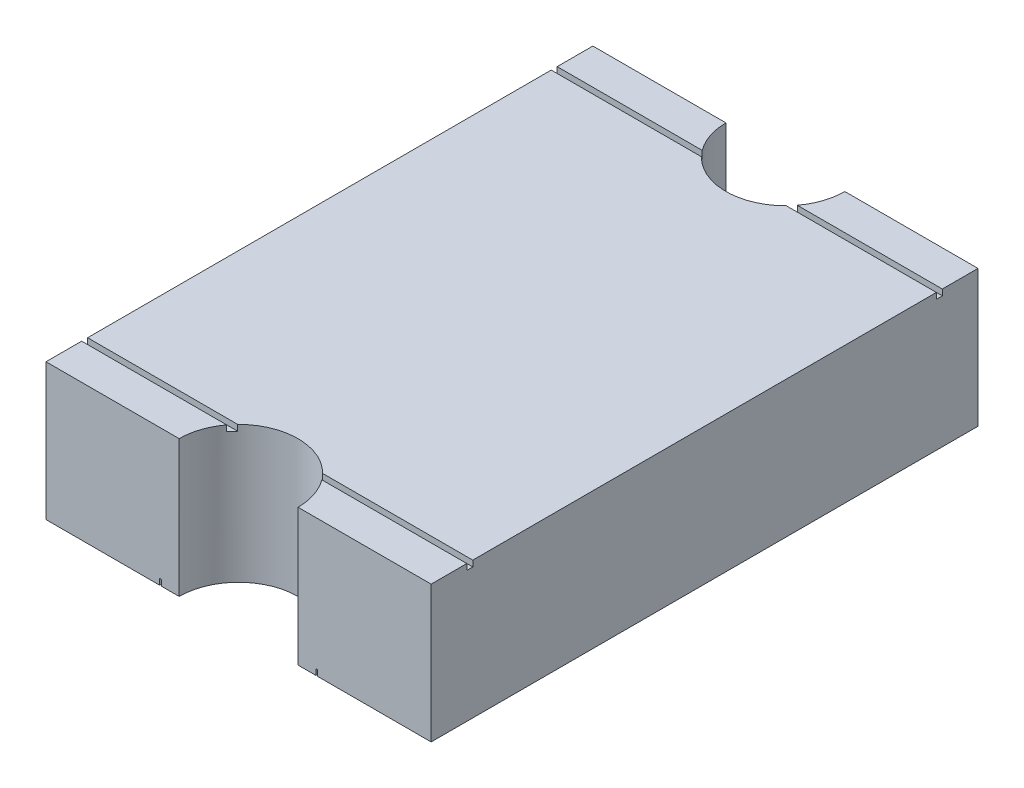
ISO-10303-21;
HEADER;
FILE_DESCRIPTION(('STEP AP214'),'2;1');
FILE_NAME('part.step','',(''),(''),'','','');
FILE_SCHEMA(('AUTOMOTIVE_DESIGN { 1 0 10303 214 1 1 1 1 }'));
ENDSEC;
DATA;
#1=APPLICATION_CONTEXT('core data for automotive mechanical design processes');
#2=APPLICATION_PROTOCOL_DEFINITION('international standard','automotive_design',2000,#1);
#3=PRODUCT_CONTEXT('',#1,'mechanical');
#4=PRODUCT('Part','Part','',(#3));
#5=PRODUCT_RELATED_PRODUCT_CATEGORY('part','',(#4));
#6=PRODUCT_DEFINITION_FORMATION('','',#4);
#7=PRODUCT_DEFINITION_CONTEXT('part definition',#1,'design');
#8=PRODUCT_DEFINITION('design','',#6,#7);
#9=PRODUCT_DEFINITION_SHAPE('','',#8);
#10=(LENGTH_UNIT() NAMED_UNIT(*) SI_UNIT(.MILLI.,.METRE.));
#11=(NAMED_UNIT(*) PLANE_ANGLE_UNIT() SI_UNIT($,.RADIAN.));
#12=(NAMED_UNIT(*) SI_UNIT($,.STERADIAN.) SOLID_ANGLE_UNIT());
#13=UNCERTAINTY_MEASURE_WITH_UNIT(LENGTH_MEASURE(1.E-05),#10,'distance_accuracy_value','');
#14=(GEOMETRIC_REPRESENTATION_CONTEXT(3) GLOBAL_UNCERTAINTY_ASSIGNED_CONTEXT((#13)) GLOBAL_UNIT_ASSIGNED_CONTEXT((#10,
#11,#12)) REPRESENTATION_CONTEXT('',''));
#15=CARTESIAN_POINT('',(0.,0.,0.));
#16=DIRECTION('',(0.,0.,1.));
#17=DIRECTION('',(1.,0.,0.));
#18=AXIS2_PLACEMENT_3D('',#15,#16,#17);
#19=CARTESIAN_POINT('',(0.,0.,2.3));
#20=DIRECTION('',(0.,-1.,0.));
#21=DIRECTION('',(0.,0.,1.));
#22=AXIS2_PLACEMENT_3D('',#19,#20,#21);
#23=CYLINDRICAL_SURFACE('',#22,0.65);
#24=DIRECTION('',(0.,-1.,0.));
#25=VECTOR('',#24,1.);
#26=CARTESIAN_POINT('',(-0.65,0.05,2.3));
#27=LINE('',#26,#25);
#28=CARTESIAN_POINT('',(-0.65,0.05,2.3));
#29=VERTEX_POINT('',#28);
#30=CARTESIAN_POINT('',(-0.65,0.,2.3));
#31=VERTEX_POINT('',#30);
#32=EDGE_CURVE('E382',#29,#31,#27,.T.);
#33=ORIENTED_EDGE('',*,*,#32,.F.);
#34=CARTESIAN_POINT('',(0.,0.05,2.3));
#35=DIRECTION('',(0.,1.,0.));
#36=DIRECTION('',(1.,0.,0.));
#37=AXIS2_PLACEMENT_3D('',#34,#35,#36);
#38=CIRCLE('',#37,0.65);
#39=CARTESIAN_POINT('',(0.65,0.05,2.3));
#40=VERTEX_POINT('',#39);
#41=EDGE_CURVE('E396',#40,#29,#38,.T.);
#42=ORIENTED_EDGE('',*,*,#41,.F.);
#43=DIRECTION('',(0.,-1.,0.));
#44=VECTOR('',#43,1.);
#45=CARTESIAN_POINT('',(0.65,0.05,2.3));
#46=LINE('',#45,#44);
#47=CARTESIAN_POINT('',(0.65,0.,2.3));
#48=VERTEX_POINT('',#47);
#49=EDGE_CURVE('E11',#40,#48,#46,.T.);
#50=ORIENTED_EDGE('',*,*,#49,.T.);
#51=CARTESIAN_POINT('',(0.,0.,2.3));
#52=DIRECTION('',(0.,-1.,0.));
#53=DIRECTION('',(-1.,0.,0.));
#54=AXIS2_PLACEMENT_3D('',#51,#52,#53);
#55=CIRCLE('',#54,0.65);
#56=EDGE_CURVE('E518',#31,#48,#55,.T.);
#57=ORIENTED_EDGE('',*,*,#56,.F.);
#58=EDGE_LOOP('',(#33,#42,#50,#57));
#59=FACE_BOUND('',#58,.T.);
#60=ADVANCED_FACE('F16',(#59),#23,.T.);
#61=CARTESIAN_POINT('',(0.5,0.,2.3));
#62=DIRECTION('',(0.,0.,1.));
#63=DIRECTION('',(1.,0.,0.));
#64=AXIS2_PLACEMENT_3D('',#61,#62,#63);
#65=PLANE('',#64);
#66=DIRECTION('',(0.,-1.,0.));
#67=VECTOR('',#66,1.);
#68=CARTESIAN_POINT('',(0.665,0.05,2.3));
#69=LINE('',#68,#67);
#70=CARTESIAN_POINT('',(0.665,0.05,2.3));
#71=VERTEX_POINT('',#70);
#72=CARTESIAN_POINT('',(0.665,0.,2.3));
#73=VERTEX_POINT('',#72);
#74=EDGE_CURVE('E412',#71,#73,#69,.T.);
#75=ORIENTED_EDGE('',*,*,#74,.T.);
#76=DIRECTION('',(1.,0.,0.));
#77=VECTOR('',#76,1.);
#78=CARTESIAN_POINT('',(0.665,0.,2.3));
#79=LINE('',#78,#77);
#80=CARTESIAN_POINT('',(1.62,0.,2.3));
#81=VERTEX_POINT('',#80);
#82=EDGE_CURVE('E559',#73,#81,#79,.T.);
#83=ORIENTED_EDGE('',*,*,#82,.T.);
#84=DIRECTION('',(0.,1.,0.));
#85=VECTOR('',#84,1.);
#86=CARTESIAN_POINT('',(1.62,0.,2.3));
#87=LINE('',#86,#85);
#88=CARTESIAN_POINT('',(1.62,1.15,2.3));
#89=VERTEX_POINT('',#88);
#90=EDGE_CURVE('E27',#81,#89,#87,.T.);
#91=ORIENTED_EDGE('',*,*,#90,.T.);
#92=DIRECTION('',(1.,0.,0.));
#93=VECTOR('',#92,1.);
#94=CARTESIAN_POINT('',(0.5,1.15,2.3));
#95=LINE('',#94,#93);
#96=CARTESIAN_POINT('',(0.5,1.15,2.3));
#97=VERTEX_POINT('',#96);
#98=EDGE_CURVE('E336',#97,#89,#95,.T.);
#99=ORIENTED_EDGE('',*,*,#98,.F.);
#100=DIRECTION('',(0.,1.,0.));
#101=VECTOR('',#100,1.);
#102=CARTESIAN_POINT('',(0.5,0.,2.3));
#103=LINE('',#102,#101);
#104=CARTESIAN_POINT('',(0.5,0.,2.3));
#105=VERTEX_POINT('',#104);
#106=EDGE_CURVE('E403',#105,#97,#103,.T.);
#107=ORIENTED_EDGE('',*,*,#106,.F.);
#108=DIRECTION('',(1.,0.,0.));
#109=VECTOR('',#108,1.);
#110=CARTESIAN_POINT('',(0.5,0.,2.3));
#111=LINE('',#110,#109);
#112=EDGE_CURVE('E454',#105,#48,#111,.T.);
#113=ORIENTED_EDGE('',*,*,#112,.T.);
#114=ORIENTED_EDGE('',*,*,#49,.F.);
#115=DIRECTION('',(1.,0.,0.));
#116=VECTOR('',#115,1.);
#117=CARTESIAN_POINT('',(0.65,0.05,2.3));
#118=LINE('',#117,#116);
#119=EDGE_CURVE('E373',#40,#71,#118,.T.);
#120=ORIENTED_EDGE('',*,*,#119,.T.);
#121=EDGE_LOOP('',(#75,#83,#91,#99,#107,#113,#114,#120));
#122=FACE_BOUND('',#121,.T.);
#123=ADVANCED_FACE('F745',(#122),#65,.T.);
#124=CARTESIAN_POINT('',(1.62,0.,2.3));
#125=DIRECTION('',(1.,0.,0.));
#126=DIRECTION('',(0.,1.,0.));
#127=AXIS2_PLACEMENT_3D('',#124,#125,#126);
#128=PLANE('',#127);
#129=DIRECTION('',(0.,-1.,0.));
#130=VECTOR('',#129,1.);
#131=CARTESIAN_POINT('',(1.62,1.15,-1.95));
#132=LINE('',#131,#130);
#133=CARTESIAN_POINT('',(1.62,1.15,-1.95));
#134=VERTEX_POINT('',#133);
#135=CARTESIAN_POINT('',(1.62,1.1,-1.95));
#136=VERTEX_POINT('',#135);
#137=EDGE_CURVE('E315',#134,#136,#132,.T.);
#138=ORIENTED_EDGE('',*,*,#137,.F.);
#139=DIRECTION('',(0.,0.,-1.));
#140=VECTOR('',#139,1.);
#141=CARTESIAN_POINT('',(1.62,1.15,1.95));
#142=LINE('',#141,#140);
#143=CARTESIAN_POINT('',(1.62,1.15,1.95));
#144=VERTEX_POINT('',#143);
#145=EDGE_CURVE('E324',#144,#134,#142,.T.);
#146=ORIENTED_EDGE('',*,*,#145,.F.);
#147=DIRECTION('',(0.,-1.,0.));
#148=VECTOR('',#147,1.);
#149=CARTESIAN_POINT('',(1.62,1.15,1.95));
#150=LINE('',#149,#148);
#151=CARTESIAN_POINT('',(1.62,1.1,1.95));
#152=VERTEX_POINT('',#151);
#153=EDGE_CURVE('E404',#144,#152,#150,.T.);
#154=ORIENTED_EDGE('',*,*,#153,.T.);
#155=DIRECTION('',(0.,0.,1.));
#156=VECTOR('',#155,1.);
#157=CARTESIAN_POINT('',(1.62,1.1,1.95));
#158=LINE('',#157,#156);
#159=CARTESIAN_POINT('',(1.62,1.1,2.));
#160=VERTEX_POINT('',#159);
#161=EDGE_CURVE('E465',#152,#160,#158,.T.);
#162=ORIENTED_EDGE('',*,*,#161,.T.);
#163=DIRECTION('',(0.,-1.,0.));
#164=VECTOR('',#163,1.);
#165=CARTESIAN_POINT('',(1.62,1.15,2.));
#166=LINE('',#165,#164);
#167=CARTESIAN_POINT('',(1.62,1.15,2.));
#168=VERTEX_POINT('',#167);
#169=EDGE_CURVE('E201',#168,#160,#166,.T.);
#170=ORIENTED_EDGE('',*,*,#169,.F.);
#171=DIRECTION('',(0.,0.,-1.));
#172=VECTOR('',#171,1.);
#173=CARTESIAN_POINT('',(1.62,1.15,2.3));
#174=LINE('',#173,#172);
#175=EDGE_CURVE('E331',#89,#168,#174,.T.);
#176=ORIENTED_EDGE('',*,*,#175,.F.);
#177=ORIENTED_EDGE('',*,*,#90,.F.);
#178=DIRECTION('',(0.,0.,-1.));
#179=VECTOR('',#178,1.);
#180=CARTESIAN_POINT('',(1.62,0.,2.3));
#181=LINE('',#180,#179);
#182=CARTESIAN_POINT('',(1.62,0.,-2.3));
#183=VERTEX_POINT('',#182);
#184=EDGE_CURVE('E408',#81,#183,#181,.T.);
#185=ORIENTED_EDGE('',*,*,#184,.T.);
#186=DIRECTION('',(0.,1.,0.));
#187=VECTOR('',#186,1.);
#188=CARTESIAN_POINT('',(1.62,0.,-2.3));
#189=LINE('',#188,#187);
#190=CARTESIAN_POINT('',(1.62,1.15,-2.3));
#191=VERTEX_POINT('',#190);
#192=EDGE_CURVE('E431',#183,#191,#189,.T.);
#193=ORIENTED_EDGE('',*,*,#192,.T.);
#194=DIRECTION('',(0.,0.,-1.));
#195=VECTOR('',#194,1.);
#196=CARTESIAN_POINT('',(1.62,1.15,-2.));
#197=LINE('',#196,#195);
#198=CARTESIAN_POINT('',(1.62,1.15,-2.));
#199=VERTEX_POINT('',#198);
#200=EDGE_CURVE('E273',#199,#191,#197,.T.);
#201=ORIENTED_EDGE('',*,*,#200,.F.);
#202=DIRECTION('',(0.,-1.,0.));
#203=VECTOR('',#202,1.);
#204=CARTESIAN_POINT('',(1.62,1.15,-2.));
#205=LINE('',#204,#203);
#206=CARTESIAN_POINT('',(1.62,1.1,-2.));
#207=VERTEX_POINT('',#206);
#208=EDGE_CURVE('E41',#199,#207,#205,.T.);
#209=ORIENTED_EDGE('',*,*,#208,.T.);
#210=DIRECTION('',(0.,0.,1.));
#211=VECTOR('',#210,1.);
#212=CARTESIAN_POINT('',(1.62,1.1,-2.));
#213=LINE('',#212,#211);
#214=EDGE_CURVE('E270',#207,#136,#213,.T.);
#215=ORIENTED_EDGE('',*,*,#214,.T.);
#216=EDGE_LOOP('',(#138,#146,#154,#162,#170,#176,#177,#185,#193,#201,#209,#215));
#217=FACE_BOUND('',#216,.T.);
#218=ADVANCED_FACE('F268',(#217),#128,.T.);
#219=CARTESIAN_POINT('',(1.62,1.15,-2.));
#220=DIRECTION('',(0.,0.,-1.));
#221=DIRECTION('',(0.,-1.,0.));
#222=AXIS2_PLACEMENT_3D('',#219,#220,#221);
#223=PLANE('',#222);
#224=DIRECTION('',(0.,1.,0.));
#225=VECTOR('',#224,1.);
#226=CARTESIAN_POINT('',(0.4,1.1,-2.));
#227=LINE('',#226,#225);
#228=CARTESIAN_POINT('',(0.4,1.1,-2.));
#229=VERTEX_POINT('',#228);
#230=CARTESIAN_POINT('',(0.4,1.15,-2.));
#231=VERTEX_POINT('',#230);
#232=EDGE_CURVE('E282',#229,#231,#227,.T.);
#233=ORIENTED_EDGE('',*,*,#232,.F.);
#234=DIRECTION('',(-1.,0.,0.));
#235=VECTOR('',#234,1.);
#236=CARTESIAN_POINT('',(1.62,1.1,-2.));
#237=LINE('',#236,#235);
#238=EDGE_CURVE('E279',#207,#229,#237,.T.);
#239=ORIENTED_EDGE('',*,*,#238,.F.);
#240=ORIENTED_EDGE('',*,*,#208,.F.);
#241=DIRECTION('',(1.,0.,0.));
#242=VECTOR('',#241,1.);
#243=CARTESIAN_POINT('',(0.4,1.15,-2.));
#244=LINE('',#243,#242);
#245=EDGE_CURVE('E499',#231,#199,#244,.T.);
#246=ORIENTED_EDGE('',*,*,#245,.F.);
#247=EDGE_LOOP('',(#233,#239,#240,#246));
#248=FACE_BOUND('',#247,.T.);
#249=ADVANCED_FACE('F280',(#248),#223,.F.);
#250=CARTESIAN_POINT('',(1.62,1.15,-2.));
#251=DIRECTION('',(0.,0.,-1.));
#252=DIRECTION('',(0.,-1.,0.));
#253=AXIS2_PLACEMENT_3D('',#250,#251,#252);
#254=PLANE('',#253);
#255=DIRECTION('',(0.,-1.,0.));
#256=VECTOR('',#255,1.);
#257=CARTESIAN_POINT('',(-1.62,1.15,-2.));
#258=LINE('',#257,#256);
#259=CARTESIAN_POINT('',(-1.62,1.15,-2.));
#260=VERTEX_POINT('',#259);
#261=CARTESIAN_POINT('',(-1.62,1.1,-2.));
#262=VERTEX_POINT('',#261);
#263=EDGE_CURVE('E275',#260,#262,#258,.T.);
#264=ORIENTED_EDGE('',*,*,#263,.T.);
#265=DIRECTION('',(-1.,0.,0.));
#266=VECTOR('',#265,1.);
#267=CARTESIAN_POINT('',(-0.4,1.1,-2.));
#268=LINE('',#267,#266);
#269=CARTESIAN_POINT('',(-0.4,1.1,-2.));
#270=VERTEX_POINT('',#269);
#271=EDGE_CURVE('E388',#270,#262,#268,.T.);
#272=ORIENTED_EDGE('',*,*,#271,.F.);
#273=DIRECTION('',(0.,1.,0.));
#274=VECTOR('',#273,1.);
#275=CARTESIAN_POINT('',(-0.4,1.1,-2.));
#276=LINE('',#275,#274);
#277=CARTESIAN_POINT('',(-0.4,1.15,-2.));
#278=VERTEX_POINT('',#277);
#279=EDGE_CURVE('E389',#270,#278,#276,.T.);
#280=ORIENTED_EDGE('',*,*,#279,.T.);
#281=DIRECTION('',(1.,0.,0.));
#282=VECTOR('',#281,1.);
#283=CARTESIAN_POINT('',(-1.62,1.15,-2.));
#284=LINE('',#283,#282);
#285=EDGE_CURVE('E493',#260,#278,#284,.T.);
#286=ORIENTED_EDGE('',*,*,#285,.F.);
#287=EDGE_LOOP('',(#264,#272,#280,#286));
#288=FACE_BOUND('',#287,.T.);
#289=ADVANCED_FACE('F842',(#288),#254,.F.);
#290=CARTESIAN_POINT('',(-1.62,0.,-2.3));
#291=DIRECTION('',(-1.,0.,0.));
#292=DIRECTION('',(0.,0.,1.));
#293=AXIS2_PLACEMENT_3D('',#290,#291,#292);
#294=PLANE('',#293);
#295=ORIENTED_EDGE('',*,*,#263,.F.);
#296=DIRECTION('',(0.,0.,1.));
#297=VECTOR('',#296,1.);
#298=CARTESIAN_POINT('',(-1.62,1.15,-2.3));
#299=LINE('',#298,#297);
#300=CARTESIAN_POINT('',(-1.62,1.15,-2.3));
#301=VERTEX_POINT('',#300);
#302=EDGE_CURVE('E339',#301,#260,#299,.T.);
#303=ORIENTED_EDGE('',*,*,#302,.F.);
#304=DIRECTION('',(0.,1.,0.));
#305=VECTOR('',#304,1.);
#306=CARTESIAN_POINT('',(-1.62,0.,-2.3));
#307=LINE('',#306,#305);
#308=CARTESIAN_POINT('',(-1.62,0.,-2.3));
#309=VERTEX_POINT('',#308);
#310=EDGE_CURVE('E367',#309,#301,#307,.T.);
#311=ORIENTED_EDGE('',*,*,#310,.F.);
#312=DIRECTION('',(0.,0.,1.));
#313=VECTOR('',#312,1.);
#314=CARTESIAN_POINT('',(-1.62,0.,-2.3));
#315=LINE('',#314,#313);
#316=CARTESIAN_POINT('',(-1.62,0.,2.3));
#317=VERTEX_POINT('',#316);
#318=EDGE_CURVE('E364',#309,#317,#315,.T.);
#319=ORIENTED_EDGE('',*,*,#318,.T.);
#320=DIRECTION('',(0.,1.,0.));
#321=VECTOR('',#320,1.);
#322=CARTESIAN_POINT('',(-1.62,0.,2.3));
#323=LINE('',#322,#321);
#324=CARTESIAN_POINT('',(-1.62,1.15,2.3));
#325=VERTEX_POINT('',#324);
#326=EDGE_CURVE('E417',#317,#325,#323,.T.);
#327=ORIENTED_EDGE('',*,*,#326,.T.);
#328=DIRECTION('',(0.,0.,1.));
#329=VECTOR('',#328,1.);
#330=CARTESIAN_POINT('',(-1.62,1.15,2.));
#331=LINE('',#330,#329);
#332=CARTESIAN_POINT('',(-1.62,1.15,2.));
#333=VERTEX_POINT('',#332);
#334=EDGE_CURVE('E20',#333,#325,#331,.T.);
#335=ORIENTED_EDGE('',*,*,#334,.F.);
#336=DIRECTION('',(0.,-1.,0.));
#337=VECTOR('',#336,1.);
#338=CARTESIAN_POINT('',(-1.62,1.15,2.));
#339=LINE('',#338,#337);
#340=CARTESIAN_POINT('',(-1.62,1.1,2.));
#341=VERTEX_POINT('',#340);
#342=EDGE_CURVE('E342',#333,#341,#339,.T.);
#343=ORIENTED_EDGE('',*,*,#342,.T.);
#344=DIRECTION('',(0.,0.,1.));
#345=VECTOR('',#344,1.);
#346=CARTESIAN_POINT('',(-1.62,1.1,1.95));
#347=LINE('',#346,#345);
#348=CARTESIAN_POINT('',(-1.62,1.1,1.95));
#349=VERTEX_POINT('',#348);
#350=EDGE_CURVE('E477',#349,#341,#347,.T.);
#351=ORIENTED_EDGE('',*,*,#350,.F.);
#352=DIRECTION('',(0.,-1.,0.));
#353=VECTOR('',#352,1.);
#354=CARTESIAN_POINT('',(-1.62,1.15,1.95));
#355=LINE('',#354,#353);
#356=CARTESIAN_POINT('',(-1.62,1.15,1.95));
#357=VERTEX_POINT('',#356);
#358=EDGE_CURVE('E445',#357,#349,#355,.T.);
#359=ORIENTED_EDGE('',*,*,#358,.F.);
#360=DIRECTION('',(0.,0.,1.));
#361=VECTOR('',#360,1.);
#362=CARTESIAN_POINT('',(-1.62,1.15,-1.95));
#363=LINE('',#362,#361);
#364=CARTESIAN_POINT('',(-1.62,1.15,-1.95));
#365=VERTEX_POINT('',#364);
#366=EDGE_CURVE('E319',#365,#357,#363,.T.);
#367=ORIENTED_EDGE('',*,*,#366,.F.);
#368=DIRECTION('',(0.,-1.,0.));
#369=VECTOR('',#368,1.);
#370=CARTESIAN_POINT('',(-1.62,1.15,-1.95));
#371=LINE('',#370,#369);
#372=CARTESIAN_POINT('',(-1.62,1.1,-1.95));
#373=VERTEX_POINT('',#372);
#374=EDGE_CURVE('E310',#365,#373,#371,.T.);
#375=ORIENTED_EDGE('',*,*,#374,.T.);
#376=DIRECTION('',(0.,0.,1.));
#377=VECTOR('',#376,1.);
#378=CARTESIAN_POINT('',(-1.62,1.1,-2.));
#379=LINE('',#378,#377);
#380=EDGE_CURVE('E356',#262,#373,#379,.T.);
#381=ORIENTED_EDGE('',*,*,#380,.F.);
#382=EDGE_LOOP('',(#295,#303,#311,#319,#327,#335,#343,#351,#359,#367,#375,#381));
#383=FACE_BOUND('',#382,.T.);
#384=ADVANCED_FACE('F837',(#383),#294,.T.);
#385=CARTESIAN_POINT('',(-1.62,1.15,2.));
#386=DIRECTION('',(0.,0.,1.));
#387=DIRECTION('',(1.,0.,0.));
#388=AXIS2_PLACEMENT_3D('',#385,#386,#387);
#389=PLANE('',#388);
#390=ORIENTED_EDGE('',*,*,#169,.T.);
#391=DIRECTION('',(1.,0.,0.));
#392=VECTOR('',#391,1.);
#393=CARTESIAN_POINT('',(0.4,1.1,2.));
#394=LINE('',#393,#392);
#395=CARTESIAN_POINT('',(0.4,1.1,2.));
#396=VERTEX_POINT('',#395);
#397=EDGE_CURVE('E468',#396,#160,#394,.T.);
#398=ORIENTED_EDGE('',*,*,#397,.F.);
#399=DIRECTION('',(0.,1.,0.));
#400=VECTOR('',#399,1.);
#401=CARTESIAN_POINT('',(0.4,1.1,2.));
#402=LINE('',#401,#400);
#403=CARTESIAN_POINT('',(0.4,1.15,2.));
#404=VERTEX_POINT('',#403);
#405=EDGE_CURVE('E213',#396,#404,#402,.T.);
#406=ORIENTED_EDGE('',*,*,#405,.T.);
#407=DIRECTION('',(1.,0.,0.));
#408=VECTOR('',#407,1.);
#409=CARTESIAN_POINT('',(0.4,1.15,2.));
#410=LINE('',#409,#408);
#411=EDGE_CURVE('E335',#404,#168,#410,.T.);
#412=ORIENTED_EDGE('',*,*,#411,.T.);
#413=EDGE_LOOP('',(#390,#398,#406,#412));
#414=FACE_BOUND('',#413,.T.);
#415=ADVANCED_FACE('F841',(#414),#389,.F.);
#416=CARTESIAN_POINT('',(-1.62,1.15,2.));
#417=DIRECTION('',(0.,0.,1.));
#418=DIRECTION('',(1.,0.,0.));
#419=AXIS2_PLACEMENT_3D('',#416,#417,#418);
#420=PLANE('',#419);
#421=DIRECTION('',(0.,1.,0.));
#422=VECTOR('',#421,1.);
#423=CARTESIAN_POINT('',(-0.4,1.1,2.));
#424=LINE('',#423,#422);
#425=CARTESIAN_POINT('',(-0.4,1.1,2.));
#426=VERTEX_POINT('',#425);
#427=CARTESIAN_POINT('',(-0.4,1.15,2.));
#428=VERTEX_POINT('',#427);
#429=EDGE_CURVE('E400',#426,#428,#424,.T.);
#430=ORIENTED_EDGE('',*,*,#429,.F.);
#431=DIRECTION('',(1.,0.,0.));
#432=VECTOR('',#431,1.);
#433=CARTESIAN_POINT('',(-1.62,1.1,2.));
#434=LINE('',#433,#432);
#435=EDGE_CURVE('E287',#341,#426,#434,.T.);
#436=ORIENTED_EDGE('',*,*,#435,.F.);
#437=ORIENTED_EDGE('',*,*,#342,.F.);
#438=DIRECTION('',(1.,0.,0.));
#439=VECTOR('',#438,1.);
#440=CARTESIAN_POINT('',(-1.62,1.15,2.));
#441=LINE('',#440,#439);
#442=EDGE_CURVE('E325',#333,#428,#441,.T.);
#443=ORIENTED_EDGE('',*,*,#442,.T.);
#444=EDGE_LOOP('',(#430,#436,#437,#443));
#445=FACE_BOUND('',#444,.T.);
#446=ADVANCED_FACE('F606',(#445),#420,.F.);
#447=CARTESIAN_POINT('',(0.,0.,2.3));
#448=DIRECTION('',(0.,1.,0.));
#449=DIRECTION('',(0.,0.,1.));
#450=AXIS2_PLACEMENT_3D('',#447,#448,#449);
#451=CYLINDRICAL_SURFACE('',#450,0.5);
#452=DIRECTION('',(0.,1.,0.));
#453=VECTOR('',#452,1.);
#454=CARTESIAN_POINT('',(0.357071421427,1.1,1.95));
#455=LINE('',#454,#453);
#456=CARTESIAN_POINT('',(0.357071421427,1.1,1.95));
#457=VERTEX_POINT('',#456);
#458=CARTESIAN_POINT('',(0.357071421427,1.15,1.95));
#459=VERTEX_POINT('',#458);
#460=EDGE_CURVE('E240',#457,#459,#455,.T.);
#461=ORIENTED_EDGE('',*,*,#460,.T.);
#462=CARTESIAN_POINT('',(0.,1.15,2.3));
#463=DIRECTION('',(0.,-1.,0.));
#464=DIRECTION('',(-0.714142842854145,0.,-0.700000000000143));
#465=AXIS2_PLACEMENT_3D('',#462,#463,#464);
#466=CIRCLE('',#465,0.5);
#467=CARTESIAN_POINT('',(-0.357071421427,1.15,1.95));
#468=VERTEX_POINT('',#467);
#469=EDGE_CURVE('E374',#468,#459,#466,.T.);
#470=ORIENTED_EDGE('',*,*,#469,.F.);
#471=DIRECTION('',(0.,1.,0.));
#472=VECTOR('',#471,1.);
#473=CARTESIAN_POINT('',(-0.357071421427,1.1,1.95));
#474=LINE('',#473,#472);
#475=CARTESIAN_POINT('',(-0.357071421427,1.1,1.95));
#476=VERTEX_POINT('',#475);
#477=EDGE_CURVE('E252',#476,#468,#474,.T.);
#478=ORIENTED_EDGE('',*,*,#477,.F.);
#479=CARTESIAN_POINT('',(0.,1.1,2.3));
#480=DIRECTION('',(0.,1.,0.));
#481=DIRECTION('',(-0.714142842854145,0.,-0.700000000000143));
#482=AXIS2_PLACEMENT_3D('',#479,#480,#481);
#483=CIRCLE('',#482,0.5);
#484=EDGE_CURVE('E432',#476,#426,#483,.T.);
#485=ORIENTED_EDGE('',*,*,#484,.T.);
#486=ORIENTED_EDGE('',*,*,#429,.T.);
#487=CARTESIAN_POINT('',(0.,1.15,2.3));
#488=DIRECTION('',(0.,-1.,0.));
#489=DIRECTION('',(-1.,0.,0.));
#490=AXIS2_PLACEMENT_3D('',#487,#488,#489);
#491=CIRCLE('',#490,0.5);
#492=CARTESIAN_POINT('',(-0.5,1.15,2.3));
#493=VERTEX_POINT('',#492);
#494=EDGE_CURVE('E330',#493,#428,#491,.T.);
#495=ORIENTED_EDGE('',*,*,#494,.F.);
#496=DIRECTION('',(0.,1.,0.));
#497=VECTOR('',#496,1.);
#498=CARTESIAN_POINT('',(-0.5,0.,2.3));
#499=LINE('',#498,#497);
#500=CARTESIAN_POINT('',(-0.5,0.,2.3));
#501=VERTEX_POINT('',#500);
#502=EDGE_CURVE('E418',#501,#493,#499,.T.);
#503=ORIENTED_EDGE('',*,*,#502,.F.);
#504=CARTESIAN_POINT('',(0.,0.,2.3));
#505=DIRECTION('',(0.,-1.,0.));
#506=DIRECTION('',(-1.,0.,0.));
#507=AXIS2_PLACEMENT_3D('',#504,#505,#506);
#508=CIRCLE('',#507,0.5);
#509=EDGE_CURVE('E458',#501,#105,#508,.T.);
#510=ORIENTED_EDGE('',*,*,#509,.T.);
#511=ORIENTED_EDGE('',*,*,#106,.T.);
#512=CARTESIAN_POINT('',(0.,1.15,2.3));
#513=DIRECTION('',(0.,-1.,0.));
#514=DIRECTION('',(0.8,0.,-0.6));
#515=AXIS2_PLACEMENT_3D('',#512,#513,#514);
#516=CIRCLE('',#515,0.5);
#517=EDGE_CURVE('E329',#404,#97,#516,.T.);
#518=ORIENTED_EDGE('',*,*,#517,.F.);
#519=ORIENTED_EDGE('',*,*,#405,.F.);
#520=CARTESIAN_POINT('',(0.,1.1,2.3));
#521=DIRECTION('',(0.,1.,0.));
#522=DIRECTION('',(0.8,0.,-0.6));
#523=AXIS2_PLACEMENT_3D('',#520,#521,#522);
#524=CIRCLE('',#523,0.5);
#525=EDGE_CURVE('E314',#396,#457,#524,.T.);
#526=ORIENTED_EDGE('',*,*,#525,.T.);
#527=EDGE_LOOP('',(#461,#470,#478,#485,#486,#495,#503,#510,#511,#518,#519,#526));
#528=FACE_BOUND('',#527,.T.);
#529=ADVANCED_FACE('F608',(#528),#451,.F.);
#530=CARTESIAN_POINT('',(1.62,1.15,1.95));
#531=DIRECTION('',(0.,0.,-1.));
#532=DIRECTION('',(0.,-1.,0.));
#533=AXIS2_PLACEMENT_3D('',#530,#531,#532);
#534=PLANE('',#533);
#535=ORIENTED_EDGE('',*,*,#460,.F.);
#536=DIRECTION('',(-1.,0.,0.));
#537=VECTOR('',#536,1.);
#538=CARTESIAN_POINT('',(1.62,1.1,1.95));
#539=LINE('',#538,#537);
#540=EDGE_CURVE('E467',#152,#457,#539,.T.);
#541=ORIENTED_EDGE('',*,*,#540,.F.);
#542=ORIENTED_EDGE('',*,*,#153,.F.);
#543=DIRECTION('',(1.,0.,0.));
#544=VECTOR('',#543,1.);
#545=CARTESIAN_POINT('',(0.357071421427,1.15,1.95));
#546=LINE('',#545,#544);
#547=EDGE_CURVE('E378',#459,#144,#546,.T.);
#548=ORIENTED_EDGE('',*,*,#547,.F.);
#549=EDGE_LOOP('',(#535,#541,#542,#548));
#550=FACE_BOUND('',#549,.T.);
#551=ADVANCED_FACE('F758',(#550),#534,.F.);
#552=CARTESIAN_POINT('',(1.62,1.15,1.95));
#553=DIRECTION('',(0.,0.,-1.));
#554=DIRECTION('',(0.,-1.,0.));
#555=AXIS2_PLACEMENT_3D('',#552,#553,#554);
#556=PLANE('',#555);
#557=ORIENTED_EDGE('',*,*,#358,.T.);
#558=DIRECTION('',(-1.,0.,0.));
#559=VECTOR('',#558,1.);
#560=CARTESIAN_POINT('',(-0.357071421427,1.1,1.95));
#561=LINE('',#560,#559);
#562=EDGE_CURVE('E436',#476,#349,#561,.T.);
#563=ORIENTED_EDGE('',*,*,#562,.F.);
#564=ORIENTED_EDGE('',*,*,#477,.T.);
#565=DIRECTION('',(1.,0.,0.));
#566=VECTOR('',#565,1.);
#567=CARTESIAN_POINT('',(-1.62,1.15,1.95));
#568=LINE('',#567,#566);
#569=EDGE_CURVE('E323',#357,#468,#568,.T.);
#570=ORIENTED_EDGE('',*,*,#569,.F.);
#571=EDGE_LOOP('',(#557,#563,#564,#570));
#572=FACE_BOUND('',#571,.T.);
#573=ADVANCED_FACE('F611',(#572),#556,.F.);
#574=CARTESIAN_POINT('',(0.,1.15,0.));
#575=DIRECTION('',(0.,1.,0.));
#576=DIRECTION('',(1.,0.,0.));
#577=AXIS2_PLACEMENT_3D('',#574,#575,#576);
#578=PLANE('',#577);
#579=ORIENTED_EDGE('',*,*,#200,.T.);
#580=DIRECTION('',(-1.,0.,0.));
#581=VECTOR('',#580,1.);
#582=CARTESIAN_POINT('',(1.62,1.15,-2.3));
#583=LINE('',#582,#581);
#584=CARTESIAN_POINT('',(0.5,1.15,-2.3));
#585=VERTEX_POINT('',#584);
#586=EDGE_CURVE('E427',#191,#585,#583,.T.);
#587=ORIENTED_EDGE('',*,*,#586,.T.);
#588=CARTESIAN_POINT('',(0.,1.15,-2.3));
#589=DIRECTION('',(0.,-1.,0.));
#590=DIRECTION('',(1.,0.,0.));
#591=AXIS2_PLACEMENT_3D('',#588,#589,#590);
#592=CIRCLE('',#591,0.5);
#593=EDGE_CURVE('E343',#585,#231,#592,.T.);
#594=ORIENTED_EDGE('',*,*,#593,.T.);
#595=ORIENTED_EDGE('',*,*,#245,.T.);
#596=EDGE_LOOP('',(#579,#587,#594,#595));
#597=FACE_BOUND('',#596,.T.);
#598=ADVANCED_FACE('F757',(#597),#578,.T.);
#599=CARTESIAN_POINT('',(0.,1.15,0.));
#600=DIRECTION('',(0.,1.,0.));
#601=DIRECTION('',(1.,0.,0.));
#602=AXIS2_PLACEMENT_3D('',#599,#600,#601);
#603=PLANE('',#602);
#604=CARTESIAN_POINT('',(0.,1.15,-2.3));
#605=DIRECTION('',(0.,-1.,0.));
#606=DIRECTION('',(-0.8,0.,0.6));
#607=AXIS2_PLACEMENT_3D('',#604,#605,#606);
#608=CIRCLE('',#607,0.5);
#609=CARTESIAN_POINT('',(-0.5,1.15,-2.3));
#610=VERTEX_POINT('',#609);
#611=EDGE_CURVE('E347',#278,#610,#608,.T.);
#612=ORIENTED_EDGE('',*,*,#611,.T.);
#613=DIRECTION('',(-1.,0.,0.));
#614=VECTOR('',#613,1.);
#615=CARTESIAN_POINT('',(-0.5,1.15,-2.3));
#616=LINE('',#615,#614);
#617=EDGE_CURVE('E528',#610,#301,#616,.T.);
#618=ORIENTED_EDGE('',*,*,#617,.T.);
#619=ORIENTED_EDGE('',*,*,#302,.T.);
#620=ORIENTED_EDGE('',*,*,#285,.T.);
#621=EDGE_LOOP('',(#612,#618,#619,#620));
#622=FACE_BOUND('',#621,.T.);
#623=ADVANCED_FACE('F18',(#622),#603,.T.);
#624=CARTESIAN_POINT('',(0.,1.15,0.));
#625=DIRECTION('',(0.,1.,0.));
#626=DIRECTION('',(1.,0.,0.));
#627=AXIS2_PLACEMENT_3D('',#624,#625,#626);
#628=PLANE('',#627);
#629=ORIENTED_EDGE('',*,*,#517,.T.);
#630=ORIENTED_EDGE('',*,*,#98,.T.);
#631=ORIENTED_EDGE('',*,*,#175,.T.);
#632=ORIENTED_EDGE('',*,*,#411,.F.);
#633=EDGE_LOOP('',(#629,#630,#631,#632));
#634=FACE_BOUND('',#633,.T.);
#635=ADVANCED_FACE('F735',(#634),#628,.T.);
#636=CARTESIAN_POINT('',(0.,1.15,0.));
#637=DIRECTION('',(0.,1.,0.));
#638=DIRECTION('',(1.,0.,0.));
#639=AXIS2_PLACEMENT_3D('',#636,#637,#638);
#640=PLANE('',#639);
#641=ORIENTED_EDGE('',*,*,#334,.T.);
#642=DIRECTION('',(1.,0.,0.));
#643=VECTOR('',#642,1.);
#644=CARTESIAN_POINT('',(-1.62,1.15,2.3));
#645=LINE('',#644,#643);
#646=EDGE_CURVE('E413',#325,#493,#645,.T.);
#647=ORIENTED_EDGE('',*,*,#646,.T.);
#648=ORIENTED_EDGE('',*,*,#494,.T.);
#649=ORIENTED_EDGE('',*,*,#442,.F.);
#650=EDGE_LOOP('',(#641,#647,#648,#649));
#651=FACE_BOUND('',#650,.T.);
#652=ADVANCED_FACE('F739',(#651),#640,.T.);
#653=CARTESIAN_POINT('',(0.,1.15,0.));
#654=DIRECTION('',(0.,1.,0.));
#655=DIRECTION('',(1.,0.,0.));
#656=AXIS2_PLACEMENT_3D('',#653,#654,#655);
#657=PLANE('',#656);
#658=ORIENTED_EDGE('',*,*,#469,.T.);
#659=ORIENTED_EDGE('',*,*,#547,.T.);
#660=ORIENTED_EDGE('',*,*,#145,.T.);
#661=DIRECTION('',(1.,0.,0.));
#662=VECTOR('',#661,1.);
#663=CARTESIAN_POINT('',(0.357071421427,1.15,-1.95));
#664=LINE('',#663,#662);
#665=CARTESIAN_POINT('',(0.357071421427,1.15,-1.95));
#666=VERTEX_POINT('',#665);
#667=EDGE_CURVE('E318',#666,#134,#664,.T.);
#668=ORIENTED_EDGE('',*,*,#667,.F.);
#669=CARTESIAN_POINT('',(0.,1.15,-2.3));
#670=DIRECTION('',(0.,-1.,0.));
#671=DIRECTION('',(0.714142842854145,0.,0.700000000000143));
#672=AXIS2_PLACEMENT_3D('',#669,#670,#671);
#673=CIRCLE('',#672,0.5);
#674=CARTESIAN_POINT('',(-0.357071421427,1.15,-1.95));
#675=VERTEX_POINT('',#674);
#676=EDGE_CURVE('E507',#666,#675,#673,.T.);
#677=ORIENTED_EDGE('',*,*,#676,.T.);
#678=DIRECTION('',(1.,0.,0.));
#679=VECTOR('',#678,1.);
#680=CARTESIAN_POINT('',(-1.62,1.15,-1.95));
#681=LINE('',#680,#679);
#682=EDGE_CURVE('E313',#365,#675,#681,.T.);
#683=ORIENTED_EDGE('',*,*,#682,.F.);
#684=ORIENTED_EDGE('',*,*,#366,.T.);
#685=ORIENTED_EDGE('',*,*,#569,.T.);
#686=EDGE_LOOP('',(#658,#659,#660,#668,#677,#683,#684,#685));
#687=FACE_BOUND('',#686,.T.);
#688=ADVANCED_FACE('F797',(#687),#657,.T.);
#689=CARTESIAN_POINT('',(-1.62,1.15,-1.95));
#690=DIRECTION('',(0.,0.,1.));
#691=DIRECTION('',(1.,0.,0.));
#692=AXIS2_PLACEMENT_3D('',#689,#690,#691);
#693=PLANE('',#692);
#694=ORIENTED_EDGE('',*,*,#137,.T.);
#695=DIRECTION('',(1.,0.,0.));
#696=VECTOR('',#695,1.);
#697=CARTESIAN_POINT('',(0.357071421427,1.1,-1.95));
#698=LINE('',#697,#696);
#699=CARTESIAN_POINT('',(0.357071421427,1.1,-1.95));
#700=VERTEX_POINT('',#699);
#701=EDGE_CURVE('E291',#700,#136,#698,.T.);
#702=ORIENTED_EDGE('',*,*,#701,.F.);
#703=DIRECTION('',(0.,1.,0.));
#704=VECTOR('',#703,1.);
#705=CARTESIAN_POINT('',(0.357071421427,1.1,-1.95));
#706=LINE('',#705,#704);
#707=EDGE_CURVE('E302',#700,#666,#706,.T.);
#708=ORIENTED_EDGE('',*,*,#707,.T.);
#709=ORIENTED_EDGE('',*,*,#667,.T.);
#710=EDGE_LOOP('',(#694,#702,#708,#709));
#711=FACE_BOUND('',#710,.T.);
#712=ADVANCED_FACE('F801',(#711),#693,.F.);
#713=CARTESIAN_POINT('',(-1.62,1.15,-1.95));
#714=DIRECTION('',(0.,0.,1.));
#715=DIRECTION('',(1.,0.,0.));
#716=AXIS2_PLACEMENT_3D('',#713,#714,#715);
#717=PLANE('',#716);
#718=DIRECTION('',(0.,1.,0.));
#719=VECTOR('',#718,1.);
#720=CARTESIAN_POINT('',(-0.357071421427,1.1,-1.95));
#721=LINE('',#720,#719);
#722=CARTESIAN_POINT('',(-0.357071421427,1.1,-1.95));
#723=VERTEX_POINT('',#722);
#724=EDGE_CURVE('E503',#723,#675,#721,.T.);
#725=ORIENTED_EDGE('',*,*,#724,.F.);
#726=DIRECTION('',(1.,0.,0.));
#727=VECTOR('',#726,1.);
#728=CARTESIAN_POINT('',(-1.62,1.1,-1.95));
#729=LINE('',#728,#727);
#730=EDGE_CURVE('E298',#373,#723,#729,.T.);
#731=ORIENTED_EDGE('',*,*,#730,.F.);
#732=ORIENTED_EDGE('',*,*,#374,.F.);
#733=ORIENTED_EDGE('',*,*,#682,.T.);
#734=EDGE_LOOP('',(#725,#731,#732,#733));
#735=FACE_BOUND('',#734,.T.);
#736=ADVANCED_FACE('F679',(#735),#717,.F.);
#737=CARTESIAN_POINT('',(0.,1.1,0.));
#738=DIRECTION('',(0.,1.,0.));
#739=DIRECTION('',(1.,0.,0.));
#740=AXIS2_PLACEMENT_3D('',#737,#738,#739);
#741=PLANE('',#740);
#742=ORIENTED_EDGE('',*,*,#397,.T.);
#743=ORIENTED_EDGE('',*,*,#161,.F.);
#744=ORIENTED_EDGE('',*,*,#540,.T.);
#745=ORIENTED_EDGE('',*,*,#525,.F.);
#746=EDGE_LOOP('',(#742,#743,#744,#745));
#747=FACE_BOUND('',#746,.T.);
#748=ADVANCED_FACE('F674',(#747),#741,.T.);
#749=CARTESIAN_POINT('',(0.,1.1,0.));
#750=DIRECTION('',(0.,1.,0.));
#751=DIRECTION('',(1.,0.,0.));
#752=AXIS2_PLACEMENT_3D('',#749,#750,#751);
#753=PLANE('',#752);
#754=ORIENTED_EDGE('',*,*,#435,.T.);
#755=ORIENTED_EDGE('',*,*,#484,.F.);
#756=ORIENTED_EDGE('',*,*,#562,.T.);
#757=ORIENTED_EDGE('',*,*,#350,.T.);
#758=EDGE_LOOP('',(#754,#755,#756,#757));
#759=FACE_BOUND('',#758,.T.);
#760=ADVANCED_FACE('F602',(#759),#753,.T.);
#761=CARTESIAN_POINT('',(0.,1.1,0.));
#762=DIRECTION('',(0.,1.,0.));
#763=DIRECTION('',(1.,0.,0.));
#764=AXIS2_PLACEMENT_3D('',#761,#762,#763);
#765=PLANE('',#764);
#766=ORIENTED_EDGE('',*,*,#701,.T.);
#767=ORIENTED_EDGE('',*,*,#214,.F.);
#768=ORIENTED_EDGE('',*,*,#238,.T.);
#769=CARTESIAN_POINT('',(0.,1.1,-2.3));
#770=DIRECTION('',(0.,1.,0.));
#771=DIRECTION('',(0.714142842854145,0.,0.700000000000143));
#772=AXIS2_PLACEMENT_3D('',#769,#770,#771);
#773=CIRCLE('',#772,0.5);
#774=EDGE_CURVE('E492',#700,#229,#773,.T.);
#775=ORIENTED_EDGE('',*,*,#774,.F.);
#776=EDGE_LOOP('',(#766,#767,#768,#775));
#777=FACE_BOUND('',#776,.T.);
#778=ADVANCED_FACE('F289',(#777),#765,.T.);
#779=CARTESIAN_POINT('',(0.,1.1,0.));
#780=DIRECTION('',(0.,1.,0.));
#781=DIRECTION('',(1.,0.,0.));
#782=AXIS2_PLACEMENT_3D('',#779,#780,#781);
#783=PLANE('',#782);
#784=ORIENTED_EDGE('',*,*,#271,.T.);
#785=ORIENTED_EDGE('',*,*,#380,.T.);
#786=ORIENTED_EDGE('',*,*,#730,.T.);
#787=CARTESIAN_POINT('',(0.,1.1,-2.3));
#788=DIRECTION('',(0.,1.,0.));
#789=DIRECTION('',(-0.8,0.,0.6));
#790=AXIS2_PLACEMENT_3D('',#787,#788,#789);
#791=CIRCLE('',#790,0.5);
#792=EDGE_CURVE('E384',#270,#723,#791,.T.);
#793=ORIENTED_EDGE('',*,*,#792,.F.);
#794=EDGE_LOOP('',(#784,#785,#786,#793));
#795=FACE_BOUND('',#794,.T.);
#796=ADVANCED_FACE('F717',(#795),#783,.T.);
#797=CARTESIAN_POINT('',(0.,0.,-2.3));
#798=DIRECTION('',(0.,1.,0.));
#799=DIRECTION('',(0.,0.,1.));
#800=AXIS2_PLACEMENT_3D('',#797,#798,#799);
#801=CYLINDRICAL_SURFACE('',#800,0.5);
#802=ORIENTED_EDGE('',*,*,#724,.T.);
#803=ORIENTED_EDGE('',*,*,#676,.F.);
#804=ORIENTED_EDGE('',*,*,#707,.F.);
#805=ORIENTED_EDGE('',*,*,#774,.T.);
#806=ORIENTED_EDGE('',*,*,#232,.T.);
#807=ORIENTED_EDGE('',*,*,#593,.F.);
#808=DIRECTION('',(0.,1.,0.));
#809=VECTOR('',#808,1.);
#810=CARTESIAN_POINT('',(0.5,0.,-2.3));
#811=LINE('',#810,#809);
#812=CARTESIAN_POINT('',(0.5,0.,-2.3));
#813=VERTEX_POINT('',#812);
#814=EDGE_CURVE('E395',#813,#585,#811,.T.);
#815=ORIENTED_EDGE('',*,*,#814,.F.);
#816=CARTESIAN_POINT('',(0.,0.,-2.3));
#817=DIRECTION('',(0.,-1.,0.));
#818=DIRECTION('',(1.,0.,0.));
#819=AXIS2_PLACEMENT_3D('',#816,#817,#818);
#820=CIRCLE('',#819,0.5);
#821=CARTESIAN_POINT('',(-0.5,0.,-2.3));
#822=VERTEX_POINT('',#821);
#823=EDGE_CURVE('E509',#813,#822,#820,.T.);
#824=ORIENTED_EDGE('',*,*,#823,.T.);
#825=DIRECTION('',(0.,1.,0.));
#826=VECTOR('',#825,1.);
#827=CARTESIAN_POINT('',(-0.5,0.,-2.3));
#828=LINE('',#827,#826);
#829=EDGE_CURVE('E573',#822,#610,#828,.T.);
#830=ORIENTED_EDGE('',*,*,#829,.T.);
#831=ORIENTED_EDGE('',*,*,#611,.F.);
#832=ORIENTED_EDGE('',*,*,#279,.F.);
#833=ORIENTED_EDGE('',*,*,#792,.T.);
#834=EDGE_LOOP('',(#802,#803,#804,#805,#806,#807,#815,#824,#830,#831,#832,#833));
#835=FACE_BOUND('',#834,.T.);
#836=ADVANCED_FACE('F721',(#835),#801,.F.);
#837=CARTESIAN_POINT('',(0.,0.,-2.3));
#838=DIRECTION('',(0.,-1.,0.));
#839=DIRECTION('',(0.,0.,1.));
#840=AXIS2_PLACEMENT_3D('',#837,#838,#839);
#841=CYLINDRICAL_SURFACE('',#840,0.65);
#842=DIRECTION('',(0.,-1.,0.));
#843=VECTOR('',#842,1.);
#844=CARTESIAN_POINT('',(0.65,0.05,-2.3));
#845=LINE('',#844,#843);
#846=CARTESIAN_POINT('',(0.65,0.05,-2.3));
#847=VERTEX_POINT('',#846);
#848=CARTESIAN_POINT('',(0.65,0.,-2.3));
#849=VERTEX_POINT('',#848);
#850=EDGE_CURVE('E392',#847,#849,#845,.T.);
#851=ORIENTED_EDGE('',*,*,#850,.F.);
#852=CARTESIAN_POINT('',(0.,0.05,-2.3));
#853=DIRECTION('',(0.,1.,0.));
#854=DIRECTION('',(-1.,0.,0.));
#855=AXIS2_PLACEMENT_3D('',#852,#853,#854);
#856=CIRCLE('',#855,0.65);
#857=CARTESIAN_POINT('',(-0.65,0.05,-2.3));
#858=VERTEX_POINT('',#857);
#859=EDGE_CURVE('E304',#858,#847,#856,.T.);
#860=ORIENTED_EDGE('',*,*,#859,.F.);
#861=DIRECTION('',(0.,-1.,0.));
#862=VECTOR('',#861,1.);
#863=CARTESIAN_POINT('',(-0.65,0.05,-2.3));
#864=LINE('',#863,#862);
#865=CARTESIAN_POINT('',(-0.65,0.,-2.3));
#866=VERTEX_POINT('',#865);
#867=EDGE_CURVE('E508',#858,#866,#864,.T.);
#868=ORIENTED_EDGE('',*,*,#867,.T.);
#869=CARTESIAN_POINT('',(0.,0.,-2.3));
#870=DIRECTION('',(0.,-1.,0.));
#871=DIRECTION('',(1.,0.,0.));
#872=AXIS2_PLACEMENT_3D('',#869,#870,#871);
#873=CIRCLE('',#872,0.65);
#874=EDGE_CURVE('E562',#849,#866,#873,.T.);
#875=ORIENTED_EDGE('',*,*,#874,.F.);
#876=EDGE_LOOP('',(#851,#860,#868,#875));
#877=FACE_BOUND('',#876,.T.);
#878=ADVANCED_FACE('F711',(#877),#841,.T.);
#879=CARTESIAN_POINT('',(-0.5,0.,-2.3));
#880=DIRECTION('',(0.,0.,-1.));
#881=DIRECTION('',(0.,-1.,0.));
#882=AXIS2_PLACEMENT_3D('',#879,#880,#881);
#883=PLANE('',#882);
#884=DIRECTION('',(0.,-1.,0.));
#885=VECTOR('',#884,1.);
#886=CARTESIAN_POINT('',(-0.665,0.05,-2.3));
#887=LINE('',#886,#885);
#888=CARTESIAN_POINT('',(-0.665,0.05,-2.3));
#889=VERTEX_POINT('',#888);
#890=CARTESIAN_POINT('',(-0.665,0.,-2.3));
#891=VERTEX_POINT('',#890);
#892=EDGE_CURVE('E365',#889,#891,#887,.T.);
#893=ORIENTED_EDGE('',*,*,#892,.T.);
#894=DIRECTION('',(-1.,0.,0.));
#895=VECTOR('',#894,1.);
#896=CARTESIAN_POINT('',(-0.665,0.,-2.3));
#897=LINE('',#896,#895);
#898=EDGE_CURVE('E353',#891,#309,#897,.T.);
#899=ORIENTED_EDGE('',*,*,#898,.T.);
#900=ORIENTED_EDGE('',*,*,#310,.T.);
#901=ORIENTED_EDGE('',*,*,#617,.F.);
#902=ORIENTED_EDGE('',*,*,#829,.F.);
#903=DIRECTION('',(-1.,0.,0.));
#904=VECTOR('',#903,1.);
#905=CARTESIAN_POINT('',(-0.5,0.,-2.3));
#906=LINE('',#905,#904);
#907=EDGE_CURVE('E514',#822,#866,#906,.T.);
#908=ORIENTED_EDGE('',*,*,#907,.T.);
#909=ORIENTED_EDGE('',*,*,#867,.F.);
#910=DIRECTION('',(-1.,0.,0.));
#911=VECTOR('',#910,1.);
#912=CARTESIAN_POINT('',(-0.65,0.05,-2.3));
#913=LINE('',#912,#911);
#914=EDGE_CURVE('E309',#858,#889,#913,.T.);
#915=ORIENTED_EDGE('',*,*,#914,.T.);
#916=EDGE_LOOP('',(#893,#899,#900,#901,#902,#908,#909,#915));
#917=FACE_BOUND('',#916,.T.);
#918=ADVANCED_FACE('F706',(#917),#883,.T.);
#919=CARTESIAN_POINT('',(0.,0.,-2.3));
#920=DIRECTION('',(0.,-1.,0.));
#921=DIRECTION('',(0.,0.,1.));
#922=AXIS2_PLACEMENT_3D('',#919,#920,#921);
#923=CYLINDRICAL_SURFACE('',#922,0.665);
#924=ORIENTED_EDGE('',*,*,#892,.F.);
#925=CARTESIAN_POINT('',(0.,0.05,-2.3));
#926=DIRECTION('',(0.,-1.,0.));
#927=DIRECTION('',(1.,0.,0.));
#928=AXIS2_PLACEMENT_3D('',#925,#926,#927);
#929=CIRCLE('',#928,0.665);
#930=CARTESIAN_POINT('',(0.665,0.05,-2.3));
#931=VERTEX_POINT('',#930);
#932=EDGE_CURVE('E542',#931,#889,#929,.T.);
#933=ORIENTED_EDGE('',*,*,#932,.F.);
#934=DIRECTION('',(0.,-1.,0.));
#935=VECTOR('',#934,1.);
#936=CARTESIAN_POINT('',(0.665,0.05,-2.3));
#937=LINE('',#936,#935);
#938=CARTESIAN_POINT('',(0.665,0.,-2.3));
#939=VERTEX_POINT('',#938);
#940=EDGE_CURVE('E368',#931,#939,#937,.T.);
#941=ORIENTED_EDGE('',*,*,#940,.T.);
#942=CARTESIAN_POINT('',(0.,0.,-2.3));
#943=DIRECTION('',(0.,-1.,0.));
#944=DIRECTION('',(1.,0.,0.));
#945=AXIS2_PLACEMENT_3D('',#942,#943,#944);
#946=CIRCLE('',#945,0.665);
#947=EDGE_CURVE('E348',#939,#891,#946,.T.);
#948=ORIENTED_EDGE('',*,*,#947,.T.);
#949=EDGE_LOOP('',(#924,#933,#941,#948));
#950=FACE_BOUND('',#949,.T.);
#951=ADVANCED_FACE('F710',(#950),#923,.F.);
#952=CARTESIAN_POINT('',(1.62,0.,-2.3));
#953=DIRECTION('',(0.,0.,-1.));
#954=DIRECTION('',(0.,-1.,0.));
#955=AXIS2_PLACEMENT_3D('',#952,#953,#954);
#956=PLANE('',#955);
#957=ORIENTED_EDGE('',*,*,#850,.T.);
#958=DIRECTION('',(-1.,0.,0.));
#959=VECTOR('',#958,1.);
#960=CARTESIAN_POINT('',(0.65,0.,-2.3));
#961=LINE('',#960,#959);
#962=EDGE_CURVE('E513',#849,#813,#961,.T.);
#963=ORIENTED_EDGE('',*,*,#962,.T.);
#964=ORIENTED_EDGE('',*,*,#814,.T.);
#965=ORIENTED_EDGE('',*,*,#586,.F.);
#966=ORIENTED_EDGE('',*,*,#192,.F.);
#967=DIRECTION('',(-1.,0.,0.));
#968=VECTOR('',#967,1.);
#969=CARTESIAN_POINT('',(1.62,0.,-2.3));
#970=LINE('',#969,#968);
#971=EDGE_CURVE('E352',#183,#939,#970,.T.);
#972=ORIENTED_EDGE('',*,*,#971,.T.);
#973=ORIENTED_EDGE('',*,*,#940,.F.);
#974=DIRECTION('',(1.,0.,0.));
#975=VECTOR('',#974,1.);
#976=CARTESIAN_POINT('',(0.65,0.05,-2.3));
#977=LINE('',#976,#975);
#978=EDGE_CURVE('E308',#847,#931,#977,.T.);
#979=ORIENTED_EDGE('',*,*,#978,.F.);
#980=EDGE_LOOP('',(#957,#963,#964,#965,#966,#972,#973,#979));
#981=FACE_BOUND('',#980,.T.);
#982=ADVANCED_FACE('F763',(#981),#956,.T.);
#983=CARTESIAN_POINT('',(0.,0.05,0.));
#984=DIRECTION('',(0.,-1.,0.));
#985=DIRECTION('',(0.,0.,-1.));
#986=AXIS2_PLACEMENT_3D('',#983,#984,#985);
#987=PLANE('',#986);
#988=CARTESIAN_POINT('',(0.,0.05,2.3));
#989=DIRECTION('',(0.,-1.,0.));
#990=DIRECTION('',(-1.,0.,0.));
#991=AXIS2_PLACEMENT_3D('',#988,#989,#990);
#992=CIRCLE('',#991,0.665);
#993=CARTESIAN_POINT('',(-0.665,0.05,2.3));
#994=VERTEX_POINT('',#993);
#995=EDGE_CURVE('E383',#994,#71,#992,.T.);
#996=ORIENTED_EDGE('',*,*,#995,.T.);
#997=ORIENTED_EDGE('',*,*,#119,.F.);
#998=ORIENTED_EDGE('',*,*,#41,.T.);
#999=DIRECTION('',(-1.,0.,0.));
#1000=VECTOR('',#999,1.);
#1001=CARTESIAN_POINT('',(-0.65,0.05,2.3));
#1002=LINE('',#1001,#1000);
#1003=EDGE_CURVE('E540',#29,#994,#1002,.T.);
#1004=ORIENTED_EDGE('',*,*,#1003,.T.);
#1005=EDGE_LOOP('',(#996,#997,#998,#1004));
#1006=FACE_BOUND('',#1005,.T.);
#1007=ADVANCED_FACE('F690',(#1006),#987,.T.);
#1008=CARTESIAN_POINT('',(0.,0.05,0.));
#1009=DIRECTION('',(0.,-1.,0.));
#1010=DIRECTION('',(0.,0.,-1.));
#1011=AXIS2_PLACEMENT_3D('',#1008,#1009,#1010);
#1012=PLANE('',#1011);
#1013=ORIENTED_EDGE('',*,*,#932,.T.);
#1014=ORIENTED_EDGE('',*,*,#914,.F.);
#1015=ORIENTED_EDGE('',*,*,#859,.T.);
#1016=ORIENTED_EDGE('',*,*,#978,.T.);
#1017=EDGE_LOOP('',(#1013,#1014,#1015,#1016));
#1018=FACE_BOUND('',#1017,.T.);
#1019=ADVANCED_FACE('F685',(#1018),#1012,.T.);
#1020=CARTESIAN_POINT('',(-1.62,0.,2.3));
#1021=DIRECTION('',(0.,0.,1.));
#1022=DIRECTION('',(1.,0.,0.));
#1023=AXIS2_PLACEMENT_3D('',#1020,#1021,#1022);
#1024=PLANE('',#1023);
#1025=ORIENTED_EDGE('',*,*,#32,.T.);
#1026=DIRECTION('',(1.,0.,0.));
#1027=VECTOR('',#1026,1.);
#1028=CARTESIAN_POINT('',(-0.65,0.,2.3));
#1029=LINE('',#1028,#1027);
#1030=EDGE_CURVE('E463',#31,#501,#1029,.T.);
#1031=ORIENTED_EDGE('',*,*,#1030,.T.);
#1032=ORIENTED_EDGE('',*,*,#502,.T.);
#1033=ORIENTED_EDGE('',*,*,#646,.F.);
#1034=ORIENTED_EDGE('',*,*,#326,.F.);
#1035=DIRECTION('',(1.,0.,0.));
#1036=VECTOR('',#1035,1.);
#1037=CARTESIAN_POINT('',(-1.62,0.,2.3));
#1038=LINE('',#1037,#1036);
#1039=CARTESIAN_POINT('',(-0.665,0.,2.3));
#1040=VERTEX_POINT('',#1039);
#1041=EDGE_CURVE('E360',#317,#1040,#1038,.T.);
#1042=ORIENTED_EDGE('',*,*,#1041,.T.);
#1043=DIRECTION('',(0.,-1.,0.));
#1044=VECTOR('',#1043,1.);
#1045=CARTESIAN_POINT('',(-0.665,0.05,2.3));
#1046=LINE('',#1045,#1044);
#1047=EDGE_CURVE('E379',#994,#1040,#1046,.T.);
#1048=ORIENTED_EDGE('',*,*,#1047,.F.);
#1049=ORIENTED_EDGE('',*,*,#1003,.F.);
#1050=EDGE_LOOP('',(#1025,#1031,#1032,#1033,#1034,#1042,#1048,#1049));
#1051=FACE_BOUND('',#1050,.T.);
#1052=ADVANCED_FACE('F689',(#1051),#1024,.T.);
#1053=CARTESIAN_POINT('',(0.,0.,2.3));
#1054=DIRECTION('',(0.,-1.,0.));
#1055=DIRECTION('',(0.,0.,1.));
#1056=AXIS2_PLACEMENT_3D('',#1053,#1054,#1055);
#1057=CYLINDRICAL_SURFACE('',#1056,0.665);
#1058=ORIENTED_EDGE('',*,*,#74,.F.);
#1059=ORIENTED_EDGE('',*,*,#995,.F.);
#1060=ORIENTED_EDGE('',*,*,#1047,.T.);
#1061=CARTESIAN_POINT('',(0.,0.,2.3));
#1062=DIRECTION('',(0.,-1.,0.));
#1063=DIRECTION('',(-1.,0.,0.));
#1064=AXIS2_PLACEMENT_3D('',#1061,#1062,#1063);
#1065=CIRCLE('',#1064,0.665);
#1066=EDGE_CURVE('E459',#1040,#73,#1065,.T.);
#1067=ORIENTED_EDGE('',*,*,#1066,.T.);
#1068=EDGE_LOOP('',(#1058,#1059,#1060,#1067));
#1069=FACE_BOUND('',#1068,.T.);
#1070=ADVANCED_FACE('F696',(#1069),#1057,.F.);
#1071=CARTESIAN_POINT('',(0.,0.,0.));
#1072=DIRECTION('',(0.,1.,0.));
#1073=DIRECTION('',(1.,0.,0.));
#1074=AXIS2_PLACEMENT_3D('',#1071,#1072,#1073);
#1075=PLANE('',#1074);
#1076=ORIENTED_EDGE('',*,*,#907,.F.);
#1077=ORIENTED_EDGE('',*,*,#823,.F.);
#1078=ORIENTED_EDGE('',*,*,#962,.F.);
#1079=ORIENTED_EDGE('',*,*,#874,.T.);
#1080=EDGE_LOOP('',(#1076,#1077,#1078,#1079));
#1081=FACE_BOUND('',#1080,.T.);
#1082=ADVANCED_FACE('F700',(#1081),#1075,.F.);
#1083=CARTESIAN_POINT('',(0.,0.,0.));
#1084=DIRECTION('',(0.,1.,0.));
#1085=DIRECTION('',(1.,0.,0.));
#1086=AXIS2_PLACEMENT_3D('',#1083,#1084,#1085);
#1087=PLANE('',#1086);
#1088=ORIENTED_EDGE('',*,*,#112,.F.);
#1089=ORIENTED_EDGE('',*,*,#509,.F.);
#1090=ORIENTED_EDGE('',*,*,#1030,.F.);
#1091=ORIENTED_EDGE('',*,*,#56,.T.);
#1092=EDGE_LOOP('',(#1088,#1089,#1090,#1091));
#1093=FACE_BOUND('',#1092,.T.);
#1094=ADVANCED_FACE('F776',(#1093),#1087,.F.);
#1095=CARTESIAN_POINT('',(0.,0.,0.));
#1096=DIRECTION('',(0.,1.,0.));
#1097=DIRECTION('',(1.,0.,0.));
#1098=AXIS2_PLACEMENT_3D('',#1095,#1096,#1097);
#1099=PLANE('',#1098);
#1100=ORIENTED_EDGE('',*,*,#1041,.F.);
#1101=ORIENTED_EDGE('',*,*,#318,.F.);
#1102=ORIENTED_EDGE('',*,*,#898,.F.);
#1103=ORIENTED_EDGE('',*,*,#947,.F.);
#1104=ORIENTED_EDGE('',*,*,#971,.F.);
#1105=ORIENTED_EDGE('',*,*,#184,.F.);
#1106=ORIENTED_EDGE('',*,*,#82,.F.);
#1107=ORIENTED_EDGE('',*,*,#1066,.F.);
#1108=EDGE_LOOP('',(#1100,#1101,#1102,#1103,#1104,#1105,#1106,#1107));
#1109=FACE_BOUND('',#1108,.T.);
#1110=ADVANCED_FACE('F772',(#1109),#1099,.F.);
#1111=CLOSED_SHELL('',(#60,#123,#218,#249,#289,#384,#415,#446,#529,#551,#573,#598,#623,#635,
#652,#688,#712,#736,#748,#760,#778,#796,#836,#878,#918,#951,#982,#1007,#1019,#1052,#1070,#1082,
#1094,#1110));
#1112=MANIFOLD_SOLID_BREP('B1',#1111);
#1113=ADVANCED_BREP_SHAPE_REPRESENTATION('',(#18,#1112),#14);
#1114=SHAPE_DEFINITION_REPRESENTATION(#9,#1113);
ENDSEC;
END-ISO-10303-21;
